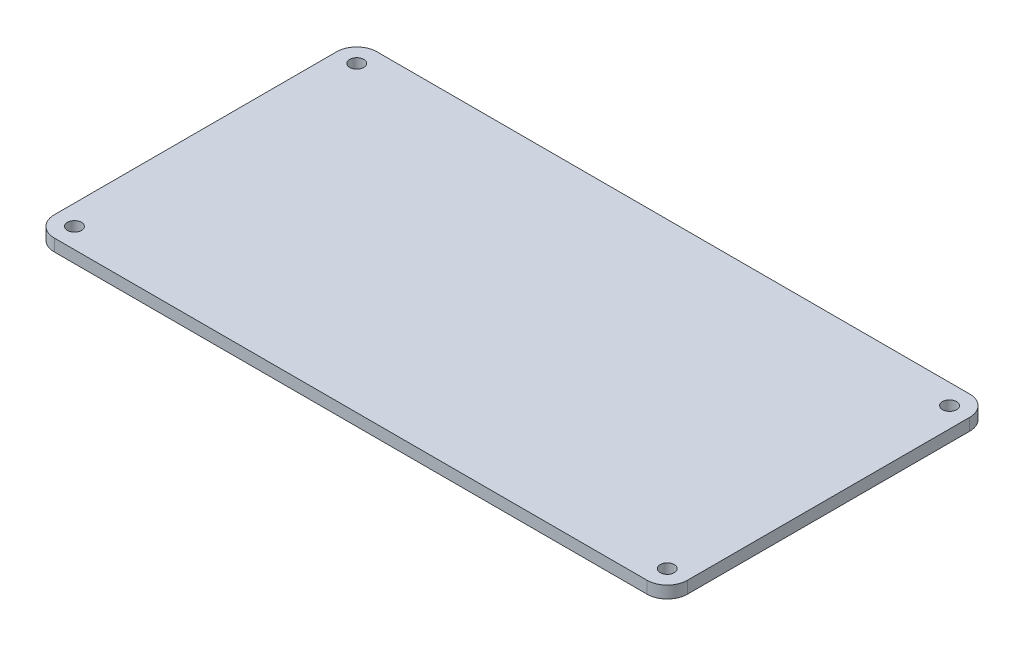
ISO-10303-21;
HEADER;
FILE_DESCRIPTION(('STEP AP214'),'2;1');
FILE_NAME('part.step','',(''),(''),'','','');
FILE_SCHEMA(('AUTOMOTIVE_DESIGN { 1 0 10303 214 1 1 1 1 }'));
ENDSEC;
DATA;
#1=APPLICATION_CONTEXT('core data for automotive mechanical design processes');
#2=APPLICATION_PROTOCOL_DEFINITION('international standard','automotive_design',2000,#1);
#3=PRODUCT_CONTEXT('',#1,'mechanical');
#4=PRODUCT('Part','Part','',(#3));
#5=PRODUCT_RELATED_PRODUCT_CATEGORY('part','',(#4));
#6=PRODUCT_DEFINITION_FORMATION('','',#4);
#7=PRODUCT_DEFINITION_CONTEXT('part definition',#1,'design');
#8=PRODUCT_DEFINITION('design','',#6,#7);
#9=PRODUCT_DEFINITION_SHAPE('','',#8);
#10=(LENGTH_UNIT() NAMED_UNIT(*) SI_UNIT(.MILLI.,.METRE.));
#11=(NAMED_UNIT(*) PLANE_ANGLE_UNIT() SI_UNIT($,.RADIAN.));
#12=(NAMED_UNIT(*) SI_UNIT($,.STERADIAN.) SOLID_ANGLE_UNIT());
#13=UNCERTAINTY_MEASURE_WITH_UNIT(LENGTH_MEASURE(1.E-05),#10,'distance_accuracy_value','');
#14=(GEOMETRIC_REPRESENTATION_CONTEXT(3) GLOBAL_UNCERTAINTY_ASSIGNED_CONTEXT((#13)) GLOBAL_UNIT_ASSIGNED_CONTEXT((#10,
#11,#12)) REPRESENTATION_CONTEXT('',''));
#15=CARTESIAN_POINT('',(0.,0.,0.));
#16=DIRECTION('',(0.,0.,1.));
#17=DIRECTION('',(1.,0.,0.));
#18=AXIS2_PLACEMENT_3D('',#15,#16,#17);
#19=CARTESIAN_POINT('',(157.,3.,40.));
#20=DIRECTION('',(-1.,0.,0.));
#21=DIRECTION('',(0.,0.,1.));
#22=AXIS2_PLACEMENT_3D('',#19,#20,#21);
#23=PLANE('',#22);
#24=DIRECTION('',(0.,0.,-1.));
#25=VECTOR('',#24,1.);
#26=CARTESIAN_POINT('',(157.,3.,40.));
#27=LINE('',#26,#25);
#28=CARTESIAN_POINT('',(157.,3.,35.));
#29=VERTEX_POINT('',#28);
#30=CARTESIAN_POINT('',(157.,3.,-35.));
#31=VERTEX_POINT('',#30);
#32=EDGE_CURVE('E131',#29,#31,#27,.T.);
#33=ORIENTED_EDGE('',*,*,#32,.F.);
#34=DIRECTION('',(0.,-1.,0.));
#35=VECTOR('',#34,1.);
#36=CARTESIAN_POINT('',(157.,3.,35.));
#37=LINE('',#36,#35);
#38=CARTESIAN_POINT('',(157.,0.,35.));
#39=VERTEX_POINT('',#38);
#40=EDGE_CURVE('E115',#29,#39,#37,.T.);
#41=ORIENTED_EDGE('',*,*,#40,.T.);
#42=DIRECTION('',(0.,0.,-1.));
#43=VECTOR('',#42,1.);
#44=CARTESIAN_POINT('',(157.,0.,40.));
#45=LINE('',#44,#43);
#46=CARTESIAN_POINT('',(157.,0.,-35.));
#47=VERTEX_POINT('',#46);
#48=EDGE_CURVE('E128',#39,#47,#45,.T.);
#49=ORIENTED_EDGE('',*,*,#48,.T.);
#50=DIRECTION('',(0.,-1.,0.));
#51=VECTOR('',#50,1.);
#52=CARTESIAN_POINT('',(157.,3.,-35.));
#53=LINE('',#52,#51);
#54=EDGE_CURVE('E134',#47,#31,#53,.F.);
#55=ORIENTED_EDGE('',*,*,#54,.T.);
#56=EDGE_LOOP('',(#33,#41,#49,#55));
#57=FACE_BOUND('',#56,.T.);
#58=ADVANCED_FACE('F42',(#57),#23,.F.);
#59=CARTESIAN_POINT('',(77.,3.,-40.));
#60=DIRECTION('',(0.,0.,1.));
#61=DIRECTION('',(1.,0.,0.));
#62=AXIS2_PLACEMENT_3D('',#59,#60,#61);
#63=PLANE('',#62);
#64=DIRECTION('',(-1.,0.,0.));
#65=VECTOR('',#64,1.);
#66=CARTESIAN_POINT('',(77.,0.,-40.));
#67=LINE('',#66,#65);
#68=CARTESIAN_POINT('',(152.,0.,-40.));
#69=VERTEX_POINT('',#68);
#70=CARTESIAN_POINT('',(5.,0.,-40.));
#71=VERTEX_POINT('',#70);
#72=EDGE_CURVE('E139',#69,#71,#67,.T.);
#73=ORIENTED_EDGE('',*,*,#72,.T.);
#74=DIRECTION('',(0.,-1.,0.));
#75=VECTOR('',#74,1.);
#76=CARTESIAN_POINT('',(5.,3.,-40.));
#77=LINE('',#76,#75);
#78=CARTESIAN_POINT('',(5.,3.,-40.));
#79=VERTEX_POINT('',#78);
#80=EDGE_CURVE('E11',#71,#79,#77,.F.);
#81=ORIENTED_EDGE('',*,*,#80,.T.);
#82=DIRECTION('',(-1.,0.,0.));
#83=VECTOR('',#82,1.);
#84=CARTESIAN_POINT('',(77.,3.,-40.));
#85=LINE('',#84,#83);
#86=CARTESIAN_POINT('',(152.,3.,-40.));
#87=VERTEX_POINT('',#86);
#88=EDGE_CURVE('E236',#87,#79,#85,.T.);
#89=ORIENTED_EDGE('',*,*,#88,.F.);
#90=DIRECTION('',(0.,-1.,0.));
#91=VECTOR('',#90,1.);
#92=CARTESIAN_POINT('',(152.,3.,-40.));
#93=LINE('',#92,#91);
#94=EDGE_CURVE('E52',#87,#69,#93,.T.);
#95=ORIENTED_EDGE('',*,*,#94,.T.);
#96=EDGE_LOOP('',(#73,#81,#89,#95));
#97=FACE_BOUND('',#96,.T.);
#98=ADVANCED_FACE('F256',(#97),#63,.F.);
#99=CARTESIAN_POINT('',(0.,3.,30.));
#100=DIRECTION('',(1.,0.,0.));
#101=DIRECTION('',(0.,0.,-1.));
#102=AXIS2_PLACEMENT_3D('',#99,#100,#101);
#103=PLANE('',#102);
#104=DIRECTION('',(0.,0.,1.));
#105=VECTOR('',#104,1.);
#106=CARTESIAN_POINT('',(0.,0.,30.));
#107=LINE('',#106,#105);
#108=CARTESIAN_POINT('',(0.,0.,-35.));
#109=VERTEX_POINT('',#108);
#110=CARTESIAN_POINT('',(0.,0.,35.));
#111=VERTEX_POINT('',#110);
#112=EDGE_CURVE('E144',#109,#111,#107,.T.);
#113=ORIENTED_EDGE('',*,*,#112,.T.);
#114=DIRECTION('',(0.,-1.,0.));
#115=VECTOR('',#114,1.);
#116=CARTESIAN_POINT('',(0.,3.,35.));
#117=LINE('',#116,#115);
#118=CARTESIAN_POINT('',(0.,3.,35.));
#119=VERTEX_POINT('',#118);
#120=EDGE_CURVE('E60',#111,#119,#117,.F.);
#121=ORIENTED_EDGE('',*,*,#120,.T.);
#122=DIRECTION('',(0.,0.,1.));
#123=VECTOR('',#122,1.);
#124=CARTESIAN_POINT('',(0.,3.,-40.));
#125=LINE('',#124,#123);
#126=CARTESIAN_POINT('',(0.,3.,-35.));
#127=VERTEX_POINT('',#126);
#128=EDGE_CURVE('E238',#127,#119,#125,.T.);
#129=ORIENTED_EDGE('',*,*,#128,.F.);
#130=DIRECTION('',(0.,-1.,0.));
#131=VECTOR('',#130,1.);
#132=CARTESIAN_POINT('',(0.,3.,-35.));
#133=LINE('',#132,#131);
#134=EDGE_CURVE('E182',#127,#109,#133,.T.);
#135=ORIENTED_EDGE('',*,*,#134,.T.);
#136=EDGE_LOOP('',(#113,#121,#129,#135));
#137=FACE_BOUND('',#136,.T.);
#138=ADVANCED_FACE('F250',(#137),#103,.F.);
#139=CARTESIAN_POINT('',(77.,3.,40.));
#140=DIRECTION('',(0.,0.,-1.));
#141=DIRECTION('',(-1.,0.,0.));
#142=AXIS2_PLACEMENT_3D('',#139,#140,#141);
#143=PLANE('',#142);
#144=DIRECTION('',(1.,0.,0.));
#145=VECTOR('',#144,1.);
#146=CARTESIAN_POINT('',(77.,0.,40.));
#147=LINE('',#146,#145);
#148=CARTESIAN_POINT('',(5.,0.,40.));
#149=VERTEX_POINT('',#148);
#150=CARTESIAN_POINT('',(152.,0.,40.));
#151=VERTEX_POINT('',#150);
#152=EDGE_CURVE('E154',#149,#151,#147,.T.);
#153=ORIENTED_EDGE('',*,*,#152,.T.);
#154=DIRECTION('',(0.,-1.,0.));
#155=VECTOR('',#154,1.);
#156=CARTESIAN_POINT('',(152.,3.,40.));
#157=LINE('',#156,#155);
#158=CARTESIAN_POINT('',(152.,3.,40.));
#159=VERTEX_POINT('',#158);
#160=EDGE_CURVE('E116',#151,#159,#157,.F.);
#161=ORIENTED_EDGE('',*,*,#160,.T.);
#162=DIRECTION('',(1.,0.,0.));
#163=VECTOR('',#162,1.);
#164=CARTESIAN_POINT('',(0.,3.,40.));
#165=LINE('',#164,#163);
#166=CARTESIAN_POINT('',(5.,3.,40.));
#167=VERTEX_POINT('',#166);
#168=EDGE_CURVE('E149',#167,#159,#165,.T.);
#169=ORIENTED_EDGE('',*,*,#168,.F.);
#170=DIRECTION('',(0.,-1.,0.));
#171=VECTOR('',#170,1.);
#172=CARTESIAN_POINT('',(5.,3.,40.));
#173=LINE('',#172,#171);
#174=EDGE_CURVE('E122',#167,#149,#173,.T.);
#175=ORIENTED_EDGE('',*,*,#174,.T.);
#176=EDGE_LOOP('',(#153,#161,#169,#175));
#177=FACE_BOUND('',#176,.T.);
#178=ADVANCED_FACE('F246',(#177),#143,.F.);
#179=CARTESIAN_POINT('',(0.,3.,0.));
#180=DIRECTION('',(0.,-1.,0.));
#181=DIRECTION('',(0.,0.,-1.));
#182=AXIS2_PLACEMENT_3D('',#179,#180,#181);
#183=PLANE('',#182);
#184=CARTESIAN_POINT('',(5.,3.,35.));
#185=DIRECTION('',(0.,1.,0.));
#186=DIRECTION('',(0.,0.,1.));
#187=AXIS2_PLACEMENT_3D('',#184,#185,#186);
#188=CIRCLE('',#187,1.75);
#189=CARTESIAN_POINT('',(5.,3.,36.75));
#190=VERTEX_POINT('',#189);
#191=EDGE_CURVE('E232',#190,#190,#188,.T.);
#192=ORIENTED_EDGE('',*,*,#191,.F.);
#193=EDGE_LOOP('',(#192));
#194=FACE_BOUND('',#193,.T.);
#195=CARTESIAN_POINT('',(152.,3.,35.));
#196=DIRECTION('',(0.,1.,0.));
#197=DIRECTION('',(0.,0.,1.));
#198=AXIS2_PLACEMENT_3D('',#195,#196,#197);
#199=CIRCLE('',#198,1.75000000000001);
#200=CARTESIAN_POINT('',(152.,3.,36.75));
#201=VERTEX_POINT('',#200);
#202=EDGE_CURVE('E228',#201,#201,#199,.T.);
#203=ORIENTED_EDGE('',*,*,#202,.F.);
#204=EDGE_LOOP('',(#203));
#205=FACE_BOUND('',#204,.T.);
#206=CARTESIAN_POINT('',(152.,3.,-35.));
#207=DIRECTION('',(0.,1.,0.));
#208=DIRECTION('',(0.,0.,1.));
#209=AXIS2_PLACEMENT_3D('',#206,#207,#208);
#210=CIRCLE('',#209,1.75000000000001);
#211=CARTESIAN_POINT('',(152.,3.,-33.25));
#212=VERTEX_POINT('',#211);
#213=EDGE_CURVE('E224',#212,#212,#210,.T.);
#214=ORIENTED_EDGE('',*,*,#213,.F.);
#215=EDGE_LOOP('',(#214));
#216=FACE_BOUND('',#215,.T.);
#217=CARTESIAN_POINT('',(5.,3.,-35.));
#218=DIRECTION('',(0.,1.,0.));
#219=DIRECTION('',(0.,0.,1.));
#220=AXIS2_PLACEMENT_3D('',#217,#218,#219);
#221=CIRCLE('',#220,1.75);
#222=CARTESIAN_POINT('',(5.,3.,-33.25));
#223=VERTEX_POINT('',#222);
#224=EDGE_CURVE('E196',#223,#223,#221,.T.);
#225=ORIENTED_EDGE('',*,*,#224,.F.);
#226=EDGE_LOOP('',(#225));
#227=FACE_BOUND('',#226,.T.);
#228=ORIENTED_EDGE('',*,*,#168,.T.);
#229=CARTESIAN_POINT('',(152.,3.,35.));
#230=DIRECTION('',(0.,-1.,0.));
#231=DIRECTION('',(0.,0.,-1.));
#232=AXIS2_PLACEMENT_3D('',#229,#230,#231);
#233=CIRCLE('',#232,5.);
#234=EDGE_CURVE('E179',#159,#29,#233,.F.);
#235=ORIENTED_EDGE('',*,*,#234,.T.);
#236=ORIENTED_EDGE('',*,*,#32,.T.);
#237=CARTESIAN_POINT('',(152.,3.,-35.));
#238=DIRECTION('',(0.,-1.,0.));
#239=DIRECTION('',(0.,0.,-1.));
#240=AXIS2_PLACEMENT_3D('',#237,#238,#239);
#241=CIRCLE('',#240,5.);
#242=EDGE_CURVE('E171',#31,#87,#241,.F.);
#243=ORIENTED_EDGE('',*,*,#242,.T.);
#244=ORIENTED_EDGE('',*,*,#88,.T.);
#245=CARTESIAN_POINT('',(5.,3.,-35.));
#246=DIRECTION('',(0.,-1.,0.));
#247=DIRECTION('',(0.,0.,-1.));
#248=AXIS2_PLACEMENT_3D('',#245,#246,#247);
#249=CIRCLE('',#248,5.);
#250=EDGE_CURVE('E67',#79,#127,#249,.F.);
#251=ORIENTED_EDGE('',*,*,#250,.T.);
#252=ORIENTED_EDGE('',*,*,#128,.T.);
#253=CARTESIAN_POINT('',(5.,3.,35.));
#254=DIRECTION('',(0.,-1.,0.));
#255=DIRECTION('',(0.,0.,-1.));
#256=AXIS2_PLACEMENT_3D('',#253,#254,#255);
#257=CIRCLE('',#256,5.);
#258=EDGE_CURVE('E176',#119,#167,#257,.F.);
#259=ORIENTED_EDGE('',*,*,#258,.T.);
#260=EDGE_LOOP('',(#228,#235,#236,#243,#244,#251,#252,#259));
#261=FACE_BOUND('',#260,.T.);
#262=ADVANCED_FACE('F208',(#194,#205,#216,#227,#261),#183,.F.);
#263=CARTESIAN_POINT('',(0.,0.,0.));
#264=DIRECTION('',(0.,-1.,0.));
#265=DIRECTION('',(0.,0.,-1.));
#266=AXIS2_PLACEMENT_3D('',#263,#264,#265);
#267=PLANE('',#266);
#268=CARTESIAN_POINT('',(5.,0.,35.));
#269=DIRECTION('',(0.,-1.,0.));
#270=DIRECTION('',(0.,0.,-1.));
#271=AXIS2_PLACEMENT_3D('',#268,#269,#270);
#272=CIRCLE('',#271,1.75);
#273=CARTESIAN_POINT('',(5.,0.,33.25));
#274=VERTEX_POINT('',#273);
#275=EDGE_CURVE('E46',#274,#274,#272,.T.);
#276=ORIENTED_EDGE('',*,*,#275,.F.);
#277=EDGE_LOOP('',(#276));
#278=FACE_BOUND('',#277,.T.);
#279=CARTESIAN_POINT('',(152.,0.,35.));
#280=DIRECTION('',(0.,-1.,0.));
#281=DIRECTION('',(0.,0.,-1.));
#282=AXIS2_PLACEMENT_3D('',#279,#280,#281);
#283=CIRCLE('',#282,1.75000000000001);
#284=CARTESIAN_POINT('',(152.,0.,33.25));
#285=VERTEX_POINT('',#284);
#286=EDGE_CURVE('E147',#285,#285,#283,.T.);
#287=ORIENTED_EDGE('',*,*,#286,.F.);
#288=EDGE_LOOP('',(#287));
#289=FACE_BOUND('',#288,.T.);
#290=CARTESIAN_POINT('',(152.,0.,-35.));
#291=DIRECTION('',(0.,-1.,0.));
#292=DIRECTION('',(0.,0.,-1.));
#293=AXIS2_PLACEMENT_3D('',#290,#291,#292);
#294=CIRCLE('',#293,1.75000000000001);
#295=CARTESIAN_POINT('',(152.,0.,-36.75));
#296=VERTEX_POINT('',#295);
#297=EDGE_CURVE('E195',#296,#296,#294,.T.);
#298=ORIENTED_EDGE('',*,*,#297,.F.);
#299=EDGE_LOOP('',(#298));
#300=FACE_BOUND('',#299,.T.);
#301=CARTESIAN_POINT('',(5.,0.,-35.));
#302=DIRECTION('',(0.,-1.,0.));
#303=DIRECTION('',(0.,0.,-1.));
#304=AXIS2_PLACEMENT_3D('',#301,#302,#303);
#305=CIRCLE('',#304,1.75);
#306=CARTESIAN_POINT('',(5.,0.,-36.75));
#307=VERTEX_POINT('',#306);
#308=EDGE_CURVE('E191',#307,#307,#305,.T.);
#309=ORIENTED_EDGE('',*,*,#308,.F.);
#310=EDGE_LOOP('',(#309));
#311=FACE_BOUND('',#310,.T.);
#312=ORIENTED_EDGE('',*,*,#48,.F.);
#313=CARTESIAN_POINT('',(152.,0.,35.));
#314=DIRECTION('',(0.,-1.,0.));
#315=DIRECTION('',(0.,0.,-1.));
#316=AXIS2_PLACEMENT_3D('',#313,#314,#315);
#317=CIRCLE('',#316,5.);
#318=EDGE_CURVE('E111',#39,#151,#317,.T.);
#319=ORIENTED_EDGE('',*,*,#318,.T.);
#320=ORIENTED_EDGE('',*,*,#152,.F.);
#321=CARTESIAN_POINT('',(5.,0.,35.));
#322=DIRECTION('',(0.,-1.,0.));
#323=DIRECTION('',(0.,0.,-1.));
#324=AXIS2_PLACEMENT_3D('',#321,#322,#323);
#325=CIRCLE('',#324,5.);
#326=EDGE_CURVE('E123',#149,#111,#325,.T.);
#327=ORIENTED_EDGE('',*,*,#326,.T.);
#328=ORIENTED_EDGE('',*,*,#112,.F.);
#329=CARTESIAN_POINT('',(5.,0.,-35.));
#330=DIRECTION('',(0.,-1.,0.));
#331=DIRECTION('',(0.,0.,-1.));
#332=AXIS2_PLACEMENT_3D('',#329,#330,#331);
#333=CIRCLE('',#332,5.);
#334=EDGE_CURVE('E161',#109,#71,#333,.T.);
#335=ORIENTED_EDGE('',*,*,#334,.T.);
#336=ORIENTED_EDGE('',*,*,#72,.F.);
#337=CARTESIAN_POINT('',(152.,0.,-35.));
#338=DIRECTION('',(0.,-1.,0.));
#339=DIRECTION('',(0.,0.,-1.));
#340=AXIS2_PLACEMENT_3D('',#337,#338,#339);
#341=CIRCLE('',#340,5.);
#342=EDGE_CURVE('E133',#69,#47,#341,.T.);
#343=ORIENTED_EDGE('',*,*,#342,.T.);
#344=EDGE_LOOP('',(#312,#319,#320,#327,#328,#335,#336,#343));
#345=FACE_BOUND('',#344,.T.);
#346=ADVANCED_FACE('F136',(#278,#289,#300,#311,#345),#267,.T.);
#347=CARTESIAN_POINT('',(152.,3.,35.));
#348=DIRECTION('',(0.,-1.,0.));
#349=DIRECTION('',(0.,0.,-1.));
#350=AXIS2_PLACEMENT_3D('',#347,#348,#349);
#351=CYLINDRICAL_SURFACE('',#350,5.);
#352=ORIENTED_EDGE('',*,*,#234,.F.);
#353=ORIENTED_EDGE('',*,*,#160,.F.);
#354=ORIENTED_EDGE('',*,*,#318,.F.);
#355=ORIENTED_EDGE('',*,*,#40,.F.);
#356=EDGE_LOOP('',(#352,#353,#354,#355));
#357=FACE_BOUND('',#356,.T.);
#358=ADVANCED_FACE('F114',(#357),#351,.T.);
#359=CARTESIAN_POINT('',(5.,3.,35.));
#360=DIRECTION('',(0.,-1.,0.));
#361=DIRECTION('',(0.,0.,-1.));
#362=AXIS2_PLACEMENT_3D('',#359,#360,#361);
#363=CYLINDRICAL_SURFACE('',#362,5.);
#364=ORIENTED_EDGE('',*,*,#258,.F.);
#365=ORIENTED_EDGE('',*,*,#120,.F.);
#366=ORIENTED_EDGE('',*,*,#326,.F.);
#367=ORIENTED_EDGE('',*,*,#174,.F.);
#368=EDGE_LOOP('',(#364,#365,#366,#367));
#369=FACE_BOUND('',#368,.T.);
#370=ADVANCED_FACE('F248',(#369),#363,.T.);
#371=CARTESIAN_POINT('',(5.,3.,-35.));
#372=DIRECTION('',(0.,-1.,0.));
#373=DIRECTION('',(0.,0.,-1.));
#374=AXIS2_PLACEMENT_3D('',#371,#372,#373);
#375=CYLINDRICAL_SURFACE('',#374,5.);
#376=ORIENTED_EDGE('',*,*,#250,.F.);
#377=ORIENTED_EDGE('',*,*,#80,.F.);
#378=ORIENTED_EDGE('',*,*,#334,.F.);
#379=ORIENTED_EDGE('',*,*,#134,.F.);
#380=EDGE_LOOP('',(#376,#377,#378,#379));
#381=FACE_BOUND('',#380,.T.);
#382=ADVANCED_FACE('F253',(#381),#375,.T.);
#383=CARTESIAN_POINT('',(152.,3.,-35.));
#384=DIRECTION('',(0.,-1.,0.));
#385=DIRECTION('',(0.,0.,-1.));
#386=AXIS2_PLACEMENT_3D('',#383,#384,#385);
#387=CYLINDRICAL_SURFACE('',#386,5.);
#388=ORIENTED_EDGE('',*,*,#242,.F.);
#389=ORIENTED_EDGE('',*,*,#54,.F.);
#390=ORIENTED_EDGE('',*,*,#342,.F.);
#391=ORIENTED_EDGE('',*,*,#94,.F.);
#392=EDGE_LOOP('',(#388,#389,#390,#391));
#393=FACE_BOUND('',#392,.T.);
#394=ADVANCED_FACE('F44',(#393),#387,.T.);
#395=CARTESIAN_POINT('',(5.,-7.,-35.));
#396=DIRECTION('',(0.,1.,0.));
#397=DIRECTION('',(0.,0.,1.));
#398=AXIS2_PLACEMENT_3D('',#395,#396,#397);
#399=CYLINDRICAL_SURFACE('',#398,1.75);
#400=ORIENTED_EDGE('',*,*,#308,.T.);
#401=EDGE_LOOP('',(#400));
#402=FACE_BOUND('',#401,.T.);
#403=ORIENTED_EDGE('',*,*,#224,.T.);
#404=EDGE_LOOP('',(#403));
#405=FACE_BOUND('',#404,.T.);
#406=ADVANCED_FACE('F215',(#402,#405),#399,.F.);
#407=CARTESIAN_POINT('',(152.,-7.,-35.));
#408=DIRECTION('',(0.,1.,0.));
#409=DIRECTION('',(0.,0.,1.));
#410=AXIS2_PLACEMENT_3D('',#407,#408,#409);
#411=CYLINDRICAL_SURFACE('',#410,1.75000000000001);
#412=ORIENTED_EDGE('',*,*,#297,.T.);
#413=EDGE_LOOP('',(#412));
#414=FACE_BOUND('',#413,.T.);
#415=ORIENTED_EDGE('',*,*,#213,.T.);
#416=EDGE_LOOP('',(#415));
#417=FACE_BOUND('',#416,.T.);
#418=ADVANCED_FACE('F218',(#414,#417),#411,.F.);
#419=CARTESIAN_POINT('',(152.,-7.,35.));
#420=DIRECTION('',(0.,1.,0.));
#421=DIRECTION('',(0.,0.,1.));
#422=AXIS2_PLACEMENT_3D('',#419,#420,#421);
#423=CYLINDRICAL_SURFACE('',#422,1.75000000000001);
#424=ORIENTED_EDGE('',*,*,#286,.T.);
#425=EDGE_LOOP('',(#424));
#426=FACE_BOUND('',#425,.T.);
#427=ORIENTED_EDGE('',*,*,#202,.T.);
#428=EDGE_LOOP('',(#427));
#429=FACE_BOUND('',#428,.T.);
#430=ADVANCED_FACE('F203',(#426,#429),#423,.F.);
#431=CARTESIAN_POINT('',(5.,-7.,35.));
#432=DIRECTION('',(0.,1.,0.));
#433=DIRECTION('',(0.,0.,1.));
#434=AXIS2_PLACEMENT_3D('',#431,#432,#433);
#435=CYLINDRICAL_SURFACE('',#434,1.75);
#436=ORIENTED_EDGE('',*,*,#275,.T.);
#437=EDGE_LOOP('',(#436));
#438=FACE_BOUND('',#437,.T.);
#439=ORIENTED_EDGE('',*,*,#191,.T.);
#440=EDGE_LOOP('',(#439));
#441=FACE_BOUND('',#440,.T.);
#442=ADVANCED_FACE('F336',(#438,#441),#435,.F.);
#443=CLOSED_SHELL('',(#58,#98,#138,#178,#262,#346,#358,#370,#382,#394,#406,#418,#430,#442));
#444=MANIFOLD_SOLID_BREP('B2',#443);
#445=ADVANCED_BREP_SHAPE_REPRESENTATION('',(#18,#444),#14);
#446=SHAPE_DEFINITION_REPRESENTATION(#9,#445);
ENDSEC;
END-ISO-10303-21;
